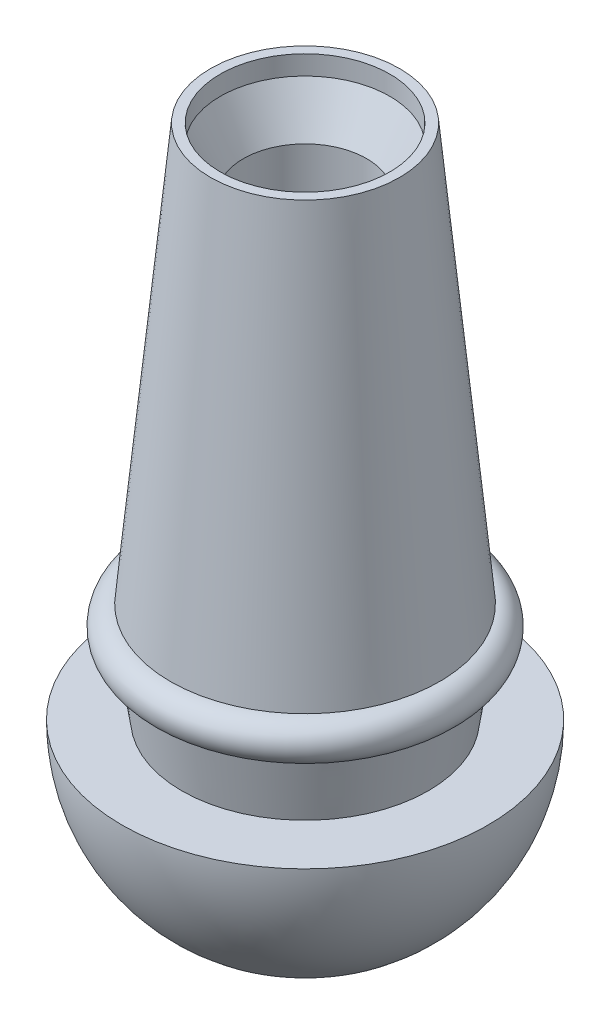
ISO-10303-21;
HEADER;
FILE_DESCRIPTION(('STEP AP214'),'2;1');
FILE_NAME('part.step','',(''),(''),'','','');
FILE_SCHEMA(('AUTOMOTIVE_DESIGN { 1 0 10303 214 1 1 1 1 }'));
ENDSEC;
DATA;
#1=APPLICATION_CONTEXT('core data for automotive mechanical design processes');
#2=APPLICATION_PROTOCOL_DEFINITION('international standard','automotive_design',2000,#1);
#3=PRODUCT_CONTEXT('',#1,'mechanical');
#4=PRODUCT('Part','Part','',(#3));
#5=PRODUCT_RELATED_PRODUCT_CATEGORY('part','',(#4));
#6=PRODUCT_DEFINITION_FORMATION('','',#4);
#7=PRODUCT_DEFINITION_CONTEXT('part definition',#1,'design');
#8=PRODUCT_DEFINITION('design','',#6,#7);
#9=PRODUCT_DEFINITION_SHAPE('','',#8);
#10=(LENGTH_UNIT() NAMED_UNIT(*) SI_UNIT(.MILLI.,.METRE.));
#11=(NAMED_UNIT(*) PLANE_ANGLE_UNIT() SI_UNIT($,.RADIAN.));
#12=(NAMED_UNIT(*) SI_UNIT($,.STERADIAN.) SOLID_ANGLE_UNIT());
#13=UNCERTAINTY_MEASURE_WITH_UNIT(LENGTH_MEASURE(1.E-05),#10,'distance_accuracy_value','');
#14=(GEOMETRIC_REPRESENTATION_CONTEXT(3) GLOBAL_UNCERTAINTY_ASSIGNED_CONTEXT((#13)) GLOBAL_UNIT_ASSIGNED_CONTEXT((#10,
#11,#12)) REPRESENTATION_CONTEXT('',''));
#15=CARTESIAN_POINT('',(0.,0.,0.));
#16=DIRECTION('',(0.,0.,1.));
#17=DIRECTION('',(1.,0.,0.));
#18=AXIS2_PLACEMENT_3D('',#15,#16,#17);
#19=CARTESIAN_POINT('',(0.,0.,0.));
#20=DIRECTION('',(0.,1.,0.));
#21=DIRECTION('',(0.,0.,1.));
#22=AXIS2_PLACEMENT_3D('',#19,#20,#21);
#23=CYLINDRICAL_SURFACE('',#22,44.);
#24=CARTESIAN_POINT('',(0.,-10.,0.));
#25=DIRECTION('',(0.,1.,0.));
#26=DIRECTION('',(0.,0.,1.));
#27=AXIS2_PLACEMENT_3D('',#24,#25,#26);
#28=CIRCLE('',#27,44.);
#29=CARTESIAN_POINT('',(0.,-10.,44.));
#30=VERTEX_POINT('',#29);
#31=EDGE_CURVE('E72',#30,#30,#28,.T.);
#32=ORIENTED_EDGE('',*,*,#31,.F.);
#33=EDGE_LOOP('',(#32));
#34=FACE_BOUND('',#33,.T.);
#35=CARTESIAN_POINT('',(0.,0.,0.));
#36=DIRECTION('',(0.,1.,0.));
#37=DIRECTION('',(0.,0.,1.));
#38=AXIS2_PLACEMENT_3D('',#35,#36,#37);
#39=CIRCLE('',#38,44.);
#40=CARTESIAN_POINT('',(0.,0.,44.));
#41=VERTEX_POINT('',#40);
#42=EDGE_CURVE('E11',#41,#41,#39,.T.);
#43=ORIENTED_EDGE('',*,*,#42,.T.);
#44=EDGE_LOOP('',(#43));
#45=FACE_BOUND('',#44,.T.);
#46=ADVANCED_FACE('F35',(#34,#45),#23,.F.);
#47=CARTESIAN_POINT('',(44.0000000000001,0.,0.));
#48=DIRECTION('',(0.,-1.,0.));
#49=DIRECTION('',(0.,0.,-1.));
#50=AXIS2_PLACEMENT_3D('',#47,#48,#49);
#51=PLANE('',#50);
#52=ORIENTED_EDGE('',*,*,#42,.F.);
#53=EDGE_LOOP('',(#52));
#54=FACE_BOUND('',#53,.T.);
#55=CARTESIAN_POINT('',(0.,0.,0.));
#56=DIRECTION('',(0.,1.,0.));
#57=DIRECTION('',(0.,0.,1.));
#58=AXIS2_PLACEMENT_3D('',#55,#56,#57);
#59=CIRCLE('',#58,49.);
#60=CARTESIAN_POINT('',(0.,0.,49.));
#61=VERTEX_POINT('',#60);
#62=EDGE_CURVE('E41',#61,#61,#59,.T.);
#63=ORIENTED_EDGE('',*,*,#62,.T.);
#64=EDGE_LOOP('',(#63));
#65=FACE_BOUND('',#64,.T.);
#66=ADVANCED_FACE('F79',(#54,#65),#51,.F.);
#67=CARTESIAN_POINT('',(0.,-216.001189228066,0.));
#68=DIRECTION('',(0.,-1.,0.));
#69=DIRECTION('',(0.,0.,-1.));
#70=AXIS2_PLACEMENT_3D('',#67,#68,#69);
#71=CONICAL_SURFACE('',#70,69.8457821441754,0.0962097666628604);
#72=ORIENTED_EDGE('',*,*,#62,.F.);
#73=EDGE_LOOP('',(#72));
#74=FACE_BOUND('',#73,.T.);
#75=CARTESIAN_POINT('',(0.,-216.001189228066,0.));
#76=DIRECTION('',(0.,1.,0.));
#77=DIRECTION('',(0.,0.,1.));
#78=AXIS2_PLACEMENT_3D('',#75,#76,#77);
#79=CIRCLE('',#78,69.8457821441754);
#80=CARTESIAN_POINT('',(0.,-216.001189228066,69.8457821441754));
#81=VERTEX_POINT('',#80);
#82=EDGE_CURVE('E45',#81,#81,#79,.T.);
#83=ORIENTED_EDGE('',*,*,#82,.T.);
#84=EDGE_LOOP('',(#83));
#85=FACE_BOUND('',#84,.T.);
#86=ADVANCED_FACE('F83',(#74,#85),#71,.T.);
#87=CARTESIAN_POINT('',(0.,-226.,0.));
#88=DIRECTION('',(0.,1.,0.));
#89=DIRECTION('',(0.,0.,1.));
#90=AXIS2_PLACEMENT_3D('',#87,#88,#89);
#91=TOROIDAL_SURFACE('',#90,70.,10.);
#92=ORIENTED_EDGE('',*,*,#82,.F.);
#93=EDGE_LOOP('',(#92));
#94=FACE_BOUND('',#93,.T.);
#95=CARTESIAN_POINT('',(0.,-235.931346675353,0.));
#96=DIRECTION('',(0.,1.,0.));
#97=DIRECTION('',(0.,0.,1.));
#98=AXIS2_PLACEMENT_3D('',#95,#96,#97);
#99=CIRCLE('',#98,68.8302336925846);
#100=CARTESIAN_POINT('',(0.,-235.931346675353,68.8302336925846));
#101=VERTEX_POINT('',#100);
#102=EDGE_CURVE('E49',#101,#101,#99,.T.);
#103=ORIENTED_EDGE('',*,*,#102,.T.);
#104=EDGE_LOOP('',(#103));
#105=FACE_BOUND('',#104,.T.);
#106=ADVANCED_FACE('F88',(#94,#105),#91,.T.);
#107=CARTESIAN_POINT('',(0.,-268.,0.));
#108=DIRECTION('',(0.,1.,0.));
#109=DIRECTION('',(0.,0.,1.));
#110=AXIS2_PLACEMENT_3D('',#107,#108,#109);
#111=CONICAL_SURFACE('',#110,64.,0.149497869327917);
#112=ORIENTED_EDGE('',*,*,#102,.F.);
#113=EDGE_LOOP('',(#112));
#114=FACE_BOUND('',#113,.T.);
#115=CARTESIAN_POINT('',(0.,-268.,0.));
#116=DIRECTION('',(0.,1.,0.));
#117=DIRECTION('',(0.,0.,1.));
#118=AXIS2_PLACEMENT_3D('',#115,#116,#117);
#119=CIRCLE('',#118,64.);
#120=CARTESIAN_POINT('',(0.,-268.,64.0000000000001));
#121=VERTEX_POINT('',#120);
#122=EDGE_CURVE('E54',#121,#121,#119,.T.);
#123=ORIENTED_EDGE('',*,*,#122,.T.);
#124=EDGE_LOOP('',(#123));
#125=FACE_BOUND('',#124,.T.);
#126=ADVANCED_FACE('F94',(#114,#125),#111,.T.);
#127=CARTESIAN_POINT('',(64.0000000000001,-268.,0.));
#128=DIRECTION('',(0.,-1.,0.));
#129=DIRECTION('',(0.,0.,-1.));
#130=AXIS2_PLACEMENT_3D('',#127,#128,#129);
#131=PLANE('',#130);
#132=ORIENTED_EDGE('',*,*,#122,.F.);
#133=EDGE_LOOP('',(#132));
#134=FACE_BOUND('',#133,.T.);
#135=CARTESIAN_POINT('',(0.,-268.,0.));
#136=DIRECTION('',(0.,1.,0.));
#137=DIRECTION('',(0.,0.,1.));
#138=AXIS2_PLACEMENT_3D('',#135,#136,#137);
#139=CIRCLE('',#138,94.8683298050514);
#140=CARTESIAN_POINT('',(0.,-268.,94.8683298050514));
#141=VERTEX_POINT('',#140);
#142=EDGE_CURVE('E57',#141,#141,#139,.T.);
#143=ORIENTED_EDGE('',*,*,#142,.T.);
#144=EDGE_LOOP('',(#143));
#145=FACE_BOUND('',#144,.T.);
#146=ADVANCED_FACE('F98',(#134,#145),#131,.F.);
#147=CARTESIAN_POINT('',(0.,-268.,0.));
#148=DIRECTION('',(0.,1.,0.));
#149=DIRECTION('',(1.,0.,0.));
#150=AXIS2_PLACEMENT_3D('',#147,#148,#149);
#151=SPHERICAL_SURFACE('',#150,94.8683298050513);
#152=ORIENTED_EDGE('',*,*,#142,.F.);
#153=EDGE_LOOP('',(#152));
#154=FACE_BOUND('',#153,.T.);
#155=CARTESIAN_POINT('',(0.,-358.,0.));
#156=DIRECTION('',(0.,1.,0.));
#157=DIRECTION('',(0.,0.,1.));
#158=AXIS2_PLACEMENT_3D('',#155,#156,#157);
#159=CIRCLE('',#158,30.);
#160=CARTESIAN_POINT('',(0.,-358.,30.0000000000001));
#161=VERTEX_POINT('',#160);
#162=EDGE_CURVE('E60',#161,#161,#159,.T.);
#163=ORIENTED_EDGE('',*,*,#162,.T.);
#164=EDGE_LOOP('',(#163));
#165=FACE_BOUND('',#164,.T.);
#166=ADVANCED_FACE('F102',(#154,#165),#151,.T.);
#167=CARTESIAN_POINT('',(0.,0.,0.));
#168=DIRECTION('',(0.,1.,0.));
#169=DIRECTION('',(0.,0.,1.));
#170=AXIS2_PLACEMENT_3D('',#167,#168,#169);
#171=CYLINDRICAL_SURFACE('',#170,30.);
#172=ORIENTED_EDGE('',*,*,#162,.F.);
#173=EDGE_LOOP('',(#172));
#174=FACE_BOUND('',#173,.T.);
#175=CARTESIAN_POINT('',(0.,-182.2,0.));
#176=DIRECTION('',(0.,1.,0.));
#177=DIRECTION('',(0.,0.,1.));
#178=AXIS2_PLACEMENT_3D('',#175,#176,#177);
#179=CIRCLE('',#178,30.);
#180=CARTESIAN_POINT('',(0.,-182.2,30.));
#181=VERTEX_POINT('',#180);
#182=EDGE_CURVE('E63',#181,#181,#179,.T.);
#183=ORIENTED_EDGE('',*,*,#182,.T.);
#184=EDGE_LOOP('',(#183));
#185=FACE_BOUND('',#184,.T.);
#186=ADVANCED_FACE('F106',(#174,#185),#171,.F.);
#187=CARTESIAN_POINT('',(0.,-163.,0.));
#188=DIRECTION('',(0.,1.,0.));
#189=DIRECTION('',(0.,0.,1.));
#190=AXIS2_PLACEMENT_3D('',#187,#188,#189);
#191=CONICAL_SURFACE('',#190,32.,0.103792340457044);
#192=ORIENTED_EDGE('',*,*,#182,.F.);
#193=EDGE_LOOP('',(#192));
#194=FACE_BOUND('',#193,.T.);
#195=CARTESIAN_POINT('',(0.,-163.,0.));
#196=DIRECTION('',(0.,1.,0.));
#197=DIRECTION('',(0.,0.,1.));
#198=AXIS2_PLACEMENT_3D('',#195,#196,#197);
#199=CIRCLE('',#198,32.);
#200=CARTESIAN_POINT('',(0.,-163.,32.0000000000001));
#201=VERTEX_POINT('',#200);
#202=EDGE_CURVE('E66',#201,#201,#199,.T.);
#203=ORIENTED_EDGE('',*,*,#202,.T.);
#204=EDGE_LOOP('',(#203));
#205=FACE_BOUND('',#204,.T.);
#206=ADVANCED_FACE('F110',(#194,#205),#191,.F.);
#207=CARTESIAN_POINT('',(0.,0.,0.));
#208=DIRECTION('',(0.,1.,0.));
#209=DIRECTION('',(0.,0.,1.));
#210=AXIS2_PLACEMENT_3D('',#207,#208,#209);
#211=CYLINDRICAL_SURFACE('',#210,32.);
#212=ORIENTED_EDGE('',*,*,#202,.F.);
#213=EDGE_LOOP('',(#212));
#214=FACE_BOUND('',#213,.T.);
#215=CARTESIAN_POINT('',(0.,-32.,0.));
#216=DIRECTION('',(0.,1.,0.));
#217=DIRECTION('',(0.,0.,1.));
#218=AXIS2_PLACEMENT_3D('',#215,#216,#217);
#219=CIRCLE('',#218,32.);
#220=CARTESIAN_POINT('',(0.,-32.,32.));
#221=VERTEX_POINT('',#220);
#222=EDGE_CURVE('E69',#221,#221,#219,.T.);
#223=ORIENTED_EDGE('',*,*,#222,.T.);
#224=EDGE_LOOP('',(#223));
#225=FACE_BOUND('',#224,.T.);
#226=ADVANCED_FACE('F114',(#214,#225),#211,.F.);
#227=CARTESIAN_POINT('',(0.,-10.,0.));
#228=DIRECTION('',(0.,1.,0.));
#229=DIRECTION('',(0.,0.,1.));
#230=AXIS2_PLACEMENT_3D('',#227,#228,#229);
#231=CONICAL_SURFACE('',#230,44.,0.499346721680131);
#232=ORIENTED_EDGE('',*,*,#222,.F.);
#233=EDGE_LOOP('',(#232));
#234=FACE_BOUND('',#233,.T.);
#235=ORIENTED_EDGE('',*,*,#31,.T.);
#236=EDGE_LOOP('',(#235));
#237=FACE_BOUND('',#236,.T.);
#238=ADVANCED_FACE('F76',(#234,#237),#231,.F.);
#239=CLOSED_SHELL('',(#46,#66,#86,#106,#126,#146,#166,#186,#206,#226,#238));
#240=MANIFOLD_SOLID_BREP('B2',#239);
#241=ADVANCED_BREP_SHAPE_REPRESENTATION('',(#18,#240),#14);
#242=SHAPE_DEFINITION_REPRESENTATION(#9,#241);
ENDSEC;
END-ISO-10303-21;
